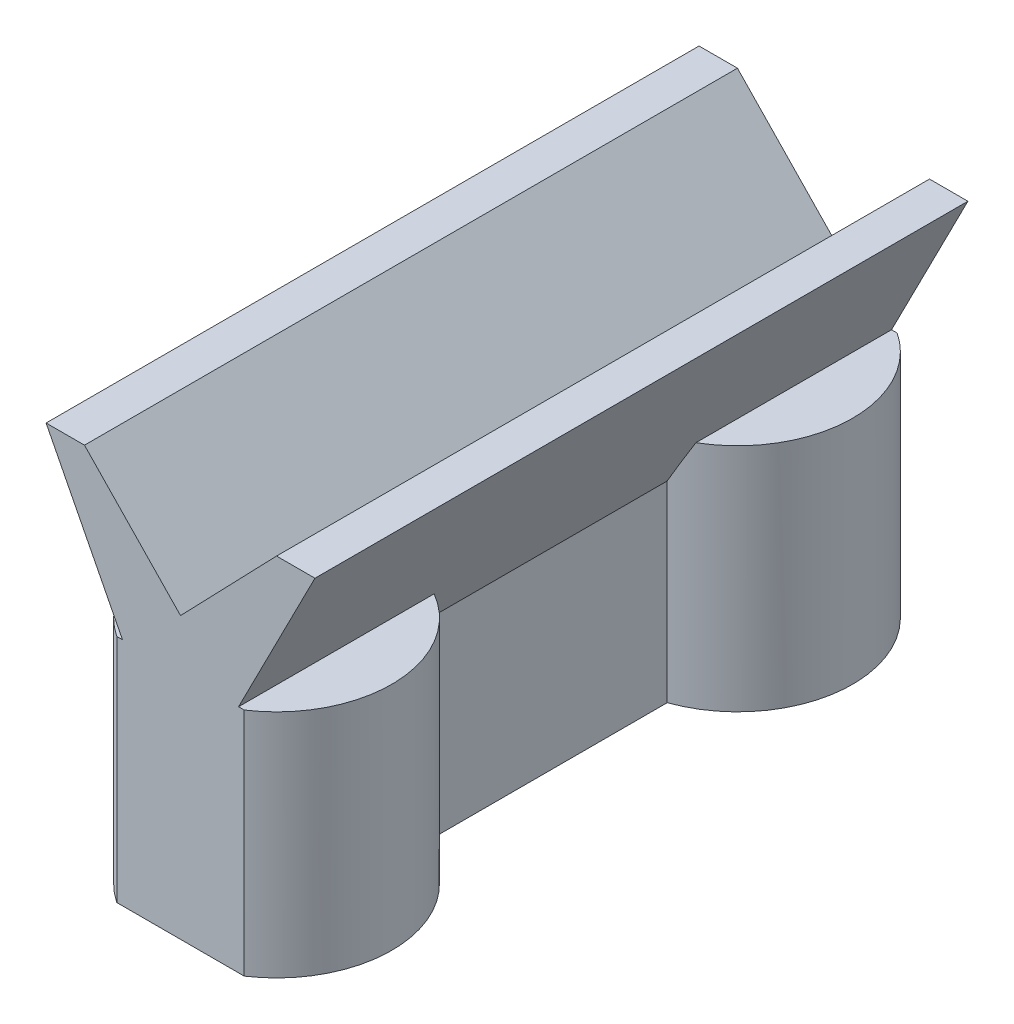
from build123d import *

# Parameters (mm, degrees)
BOSS_EXTRU_1_DEPTH      = 17
ESQUISSE2_R             = 3
BOSS_EXTRU_2_DEPTH      = 6
ESQUISSE4_W             = 7.046145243
ESQUISSE4_H             = 1.691677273
ESQUISSE4_H_2           = 1.049461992
ENL_V_MAT_EXTRU_1_DEPTH = 19.828170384
ESQUISSE5_R             = 1.3
ENL_V_MAT_EXTRU_2_DEPTH = 6


with BuildPart() as part:
    # Esquisse1 → Boss.-Extru.1 (new body)
    with BuildSketch(Plane.XY):
        Polygon((0, -8.143259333), (-1, -8.143259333), (-1, -3.143259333), (-3.5, 1.749763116), (-2.5, 1.749763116), (0, -0.843259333), align=None)
    boss_extru_1 = extrude(amount=BOSS_EXTRU_1_DEPTH)

    # Sym_trie1: Boss.-Extru.1 across plane
    add(boss_extru_1.mirror(Plane(origin=(0, -0.843259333, 17), x_dir=(0, 0, 1), z_dir=(-1, 0, 0))))

    # Esquisse2 → Boss.-Extru.2 (add)
    with BuildSketch(Plane(origin=(0, -8.143259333, 0), x_dir=(-1, 0, 0), z_dir=(0, -1, 0))):
        with Locations((0, -14.5)):
            Circle(ESQUISSE2_R)
        with Locations((0, -2.5)):
            Circle(ESQUISSE2_R)
    extrude(amount=-BOSS_EXTRU_2_DEPTH)

    # Esquisse4 → Enl_v. mat.-Extru.1 (cut, through all)
    with BuildSketch(Plane(origin=(0, -2.143259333, 0), x_dir=(1, 0, 0), z_dir=(0, 1, 0))):
        with Locations((0.023072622, -17.845838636)):
            Rectangle(ESQUISSE4_W, ESQUISSE4_H)
        with Locations((0.023072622, 0.524730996)):
            Rectangle(ESQUISSE4_W, ESQUISSE4_H_2)
    extrude(amount=-ENL_V_MAT_EXTRU_1_DEPTH, mode=Mode.SUBTRACT)

    # Esquisse5 → Enl_v. mat.-Extru.2 (cut)
    with BuildSketch(Plane.XZ.offset(8.143259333)):
        with Locations(Location((0, 14.5, 0), (0, 0, 270))):
            Circle(ESQUISSE5_R)
        with Locations(Location((0, 2.5, 0), (0, 0, 270))):
            Circle(ESQUISSE5_R)
    extrude(amount=-ENL_V_MAT_EXTRU_2_DEPTH, mode=Mode.SUBTRACT)


solid = part.part
